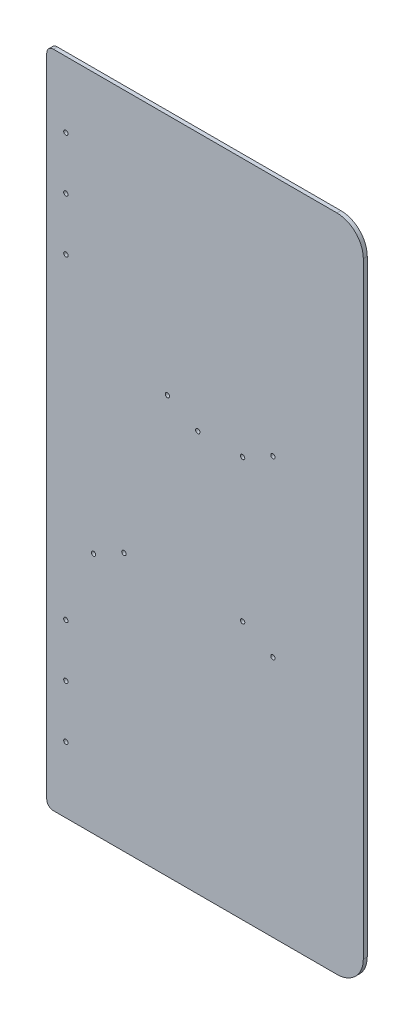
ISO-10303-21;
HEADER;
FILE_DESCRIPTION(('STEP AP214'),'2;1');
FILE_NAME('part.step','',(''),(''),'','','');
FILE_SCHEMA(('AUTOMOTIVE_DESIGN { 1 0 10303 214 1 1 1 1 }'));
ENDSEC;
DATA;
#1=APPLICATION_CONTEXT('core data for automotive mechanical design processes');
#2=APPLICATION_PROTOCOL_DEFINITION('international standard','automotive_design',2000,#1);
#3=PRODUCT_CONTEXT('',#1,'mechanical');
#4=PRODUCT('Part','Part','',(#3));
#5=PRODUCT_RELATED_PRODUCT_CATEGORY('part','',(#4));
#6=PRODUCT_DEFINITION_FORMATION('','',#4);
#7=PRODUCT_DEFINITION_CONTEXT('part definition',#1,'design');
#8=PRODUCT_DEFINITION('design','',#6,#7);
#9=PRODUCT_DEFINITION_SHAPE('','',#8);
#10=(LENGTH_UNIT() NAMED_UNIT(*) SI_UNIT(.MILLI.,.METRE.));
#11=(NAMED_UNIT(*) PLANE_ANGLE_UNIT() SI_UNIT($,.RADIAN.));
#12=(NAMED_UNIT(*) SI_UNIT($,.STERADIAN.) SOLID_ANGLE_UNIT());
#13=UNCERTAINTY_MEASURE_WITH_UNIT(LENGTH_MEASURE(1.E-05),#10,'distance_accuracy_value','');
#14=(GEOMETRIC_REPRESENTATION_CONTEXT(3) GLOBAL_UNCERTAINTY_ASSIGNED_CONTEXT((#13)) GLOBAL_UNIT_ASSIGNED_CONTEXT((#10,
#11,#12)) REPRESENTATION_CONTEXT('',''));
#15=CARTESIAN_POINT('',(0.,0.,0.));
#16=DIRECTION('',(0.,0.,1.));
#17=DIRECTION('',(1.,0.,0.));
#18=AXIS2_PLACEMENT_3D('',#15,#16,#17);
#19=CARTESIAN_POINT('',(0.,0.,3.));
#20=DIRECTION('',(1.,0.,0.));
#21=DIRECTION('',(0.,1.,0.));
#22=AXIS2_PLACEMENT_3D('',#19,#20,#21);
#23=PLANE('',#22);
#24=DIRECTION('',(0.,-1.,0.));
#25=VECTOR('',#24,1.);
#26=CARTESIAN_POINT('',(0.,0.,3.));
#27=LINE('',#26,#25);
#28=CARTESIAN_POINT('',(0.,495.,3.));
#29=VERTEX_POINT('',#28);
#30=CARTESIAN_POINT('',(0.,5.,3.));
#31=VERTEX_POINT('',#30);
#32=EDGE_CURVE('E116',#29,#31,#27,.T.);
#33=ORIENTED_EDGE('',*,*,#32,.F.);
#34=DIRECTION('',(0.,0.,-1.));
#35=VECTOR('',#34,1.);
#36=CARTESIAN_POINT('',(0.,495.,3.));
#37=LINE('',#36,#35);
#38=CARTESIAN_POINT('',(0.,495.,0.));
#39=VERTEX_POINT('',#38);
#40=EDGE_CURVE('E186',#29,#39,#37,.T.);
#41=ORIENTED_EDGE('',*,*,#40,.T.);
#42=DIRECTION('',(0.,-1.,0.));
#43=VECTOR('',#42,1.);
#44=CARTESIAN_POINT('',(0.,0.,0.));
#45=LINE('',#44,#43);
#46=CARTESIAN_POINT('',(0.,5.,0.));
#47=VERTEX_POINT('',#46);
#48=EDGE_CURVE('E168',#39,#47,#45,.T.);
#49=ORIENTED_EDGE('',*,*,#48,.T.);
#50=DIRECTION('',(0.,0.,1.));
#51=VECTOR('',#50,1.);
#52=CARTESIAN_POINT('',(0.,5.,3.));
#53=LINE('',#52,#51);
#54=EDGE_CURVE('E142',#47,#31,#53,.T.);
#55=ORIENTED_EDGE('',*,*,#54,.T.);
#56=EDGE_LOOP('',(#33,#41,#49,#55));
#57=FACE_BOUND('',#56,.T.);
#58=ADVANCED_FACE('F17',(#57),#23,.F.);
#59=CARTESIAN_POINT('',(0.,0.,3.));
#60=DIRECTION('',(0.,1.,0.));
#61=DIRECTION('',(1.,0.,0.));
#62=AXIS2_PLACEMENT_3D('',#59,#60,#61);
#63=PLANE('',#62);
#64=DIRECTION('',(1.,0.,0.));
#65=VECTOR('',#64,1.);
#66=CARTESIAN_POINT('',(0.,0.,3.));
#67=LINE('',#66,#65);
#68=CARTESIAN_POINT('',(5.,0.,3.));
#69=VERTEX_POINT('',#68);
#70=CARTESIAN_POINT('',(220.,0.,3.));
#71=VERTEX_POINT('',#70);
#72=EDGE_CURVE('E26',#69,#71,#67,.T.);
#73=ORIENTED_EDGE('',*,*,#72,.F.);
#74=DIRECTION('',(0.,0.,-1.));
#75=VECTOR('',#74,1.);
#76=CARTESIAN_POINT('',(5.,0.,3.));
#77=LINE('',#76,#75);
#78=CARTESIAN_POINT('',(5.,0.,0.));
#79=VERTEX_POINT('',#78);
#80=EDGE_CURVE('E122',#69,#79,#77,.T.);
#81=ORIENTED_EDGE('',*,*,#80,.T.);
#82=DIRECTION('',(1.,0.,0.));
#83=VECTOR('',#82,1.);
#84=CARTESIAN_POINT('',(0.,0.,0.));
#85=LINE('',#84,#83);
#86=CARTESIAN_POINT('',(220.,0.,0.));
#87=VERTEX_POINT('',#86);
#88=EDGE_CURVE('E98',#79,#87,#85,.T.);
#89=ORIENTED_EDGE('',*,*,#88,.T.);
#90=DIRECTION('',(0.,0.,1.));
#91=VECTOR('',#90,1.);
#92=CARTESIAN_POINT('',(220.,0.,3.));
#93=LINE('',#92,#91);
#94=EDGE_CURVE('E125',#87,#71,#93,.T.);
#95=ORIENTED_EDGE('',*,*,#94,.T.);
#96=EDGE_LOOP('',(#73,#81,#89,#95));
#97=FACE_BOUND('',#96,.T.);
#98=ADVANCED_FACE('F19',(#97),#63,.F.);
#99=CARTESIAN_POINT('',(240.,0.,3.));
#100=DIRECTION('',(-1.,0.,0.));
#101=DIRECTION('',(0.,0.,1.));
#102=AXIS2_PLACEMENT_3D('',#99,#100,#101);
#103=PLANE('',#102);
#104=DIRECTION('',(0.,1.,0.));
#105=VECTOR('',#104,1.);
#106=CARTESIAN_POINT('',(240.,0.,0.));
#107=LINE('',#106,#105);
#108=CARTESIAN_POINT('',(240.,20.,0.));
#109=VERTEX_POINT('',#108);
#110=CARTESIAN_POINT('',(240.,480.,0.));
#111=VERTEX_POINT('',#110);
#112=EDGE_CURVE('E53',#109,#111,#107,.T.);
#113=ORIENTED_EDGE('',*,*,#112,.T.);
#114=DIRECTION('',(0.,0.,1.));
#115=VECTOR('',#114,1.);
#116=CARTESIAN_POINT('',(240.,480.,3.));
#117=LINE('',#116,#115);
#118=CARTESIAN_POINT('',(240.,480.,3.));
#119=VERTEX_POINT('',#118);
#120=EDGE_CURVE('E205',#111,#119,#117,.T.);
#121=ORIENTED_EDGE('',*,*,#120,.T.);
#122=DIRECTION('',(0.,1.,0.));
#123=VECTOR('',#122,1.);
#124=CARTESIAN_POINT('',(240.,0.,3.));
#125=LINE('',#124,#123);
#126=CARTESIAN_POINT('',(240.,20.,3.));
#127=VERTEX_POINT('',#126);
#128=EDGE_CURVE('E11',#127,#119,#125,.T.);
#129=ORIENTED_EDGE('',*,*,#128,.F.);
#130=DIRECTION('',(0.,0.,-1.));
#131=VECTOR('',#130,1.);
#132=CARTESIAN_POINT('',(240.,20.,3.));
#133=LINE('',#132,#131);
#134=EDGE_CURVE('E198',#127,#109,#133,.T.);
#135=ORIENTED_EDGE('',*,*,#134,.T.);
#136=EDGE_LOOP('',(#113,#121,#129,#135));
#137=FACE_BOUND('',#136,.T.);
#138=ADVANCED_FACE('F290',(#137),#103,.F.);
#139=CARTESIAN_POINT('',(0.,500.,3.));
#140=DIRECTION('',(0.,-1.,0.));
#141=DIRECTION('',(0.,0.,-1.));
#142=AXIS2_PLACEMENT_3D('',#139,#140,#141);
#143=PLANE('',#142);
#144=DIRECTION('',(-1.,0.,0.));
#145=VECTOR('',#144,1.);
#146=CARTESIAN_POINT('',(0.,500.,0.));
#147=LINE('',#146,#145);
#148=CARTESIAN_POINT('',(220.,500.,0.));
#149=VERTEX_POINT('',#148);
#150=CARTESIAN_POINT('',(5.,500.,0.));
#151=VERTEX_POINT('',#150);
#152=EDGE_CURVE('E39',#149,#151,#147,.T.);
#153=ORIENTED_EDGE('',*,*,#152,.T.);
#154=DIRECTION('',(0.,0.,1.));
#155=VECTOR('',#154,1.);
#156=CARTESIAN_POINT('',(5.,500.,3.));
#157=LINE('',#156,#155);
#158=CARTESIAN_POINT('',(5.,500.,3.));
#159=VERTEX_POINT('',#158);
#160=EDGE_CURVE('E179',#151,#159,#157,.T.);
#161=ORIENTED_EDGE('',*,*,#160,.T.);
#162=DIRECTION('',(-1.,0.,0.));
#163=VECTOR('',#162,1.);
#164=CARTESIAN_POINT('',(0.,500.,3.));
#165=LINE('',#164,#163);
#166=CARTESIAN_POINT('',(220.,500.,3.));
#167=VERTEX_POINT('',#166);
#168=EDGE_CURVE('E157',#167,#159,#165,.T.);
#169=ORIENTED_EDGE('',*,*,#168,.F.);
#170=DIRECTION('',(0.,0.,-1.));
#171=VECTOR('',#170,1.);
#172=CARTESIAN_POINT('',(220.,500.,3.));
#173=LINE('',#172,#171);
#174=EDGE_CURVE('E209',#167,#149,#173,.T.);
#175=ORIENTED_EDGE('',*,*,#174,.T.);
#176=EDGE_LOOP('',(#153,#161,#169,#175));
#177=FACE_BOUND('',#176,.T.);
#178=ADVANCED_FACE('F278',(#177),#143,.F.);
#179=CARTESIAN_POINT('',(0.,0.,3.));
#180=DIRECTION('',(0.,0.,-1.));
#181=DIRECTION('',(0.,-1.,0.));
#182=AXIS2_PLACEMENT_3D('',#179,#180,#181);
#183=PLANE('',#182);
#184=CARTESIAN_POINT('',(14.5000000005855,449.999999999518,3.));
#185=DIRECTION('',(0.,0.,-1.));
#186=DIRECTION('',(-1.,0.,0.));
#187=AXIS2_PLACEMENT_3D('',#184,#185,#186);
#188=CIRCLE('',#187,1.65000000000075);
#189=CARTESIAN_POINT('',(12.8500000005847,449.999999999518,3.));
#190=VERTEX_POINT('',#189);
#191=EDGE_CURVE('E662',#190,#190,#188,.T.);
#192=ORIENTED_EDGE('',*,*,#191,.T.);
#193=EDGE_LOOP('',(#192));
#194=FACE_BOUND('',#193,.T.);
#195=CARTESIAN_POINT('',(14.5000000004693,409.999999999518,3.));
#196=DIRECTION('',(0.,0.,-1.));
#197=DIRECTION('',(-1.,0.,0.));
#198=AXIS2_PLACEMENT_3D('',#195,#196,#197);
#199=CIRCLE('',#198,1.65000000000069);
#200=CARTESIAN_POINT('',(12.8500000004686,409.999999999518,3.));
#201=VERTEX_POINT('',#200);
#202=EDGE_CURVE('E646',#201,#201,#199,.T.);
#203=ORIENTED_EDGE('',*,*,#202,.T.);
#204=EDGE_LOOP('',(#203));
#205=FACE_BOUND('',#204,.T.);
#206=CARTESIAN_POINT('',(14.5000000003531,369.999999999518,3.));
#207=DIRECTION('',(0.,0.,-1.));
#208=DIRECTION('',(-1.,0.,0.));
#209=AXIS2_PLACEMENT_3D('',#206,#207,#208);
#210=CIRCLE('',#209,1.65000000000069);
#211=CARTESIAN_POINT('',(12.8500000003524,369.999999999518,3.));
#212=VERTEX_POINT('',#211);
#213=EDGE_CURVE('E630',#212,#212,#210,.T.);
#214=ORIENTED_EDGE('',*,*,#213,.T.);
#215=EDGE_LOOP('',(#214));
#216=FACE_BOUND('',#215,.T.);
#217=CARTESIAN_POINT('',(14.5000000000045,49.9999999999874,3.));
#218=DIRECTION('',(0.,0.,1.));
#219=DIRECTION('',(1.,0.,0.));
#220=AXIS2_PLACEMENT_3D('',#217,#218,#219);
#221=CIRCLE('',#220,1.64999999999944);
#222=CARTESIAN_POINT('',(16.1500000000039,49.9999999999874,3.));
#223=VERTEX_POINT('',#222);
#224=EDGE_CURVE('E607',#223,#223,#221,.T.);
#225=ORIENTED_EDGE('',*,*,#224,.F.);
#226=EDGE_LOOP('',(#225));
#227=FACE_BOUND('',#226,.T.);
#228=CARTESIAN_POINT('',(14.5000000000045,129.999999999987,3.));
#229=DIRECTION('',(0.,0.,1.));
#230=DIRECTION('',(1.,0.,0.));
#231=AXIS2_PLACEMENT_3D('',#228,#229,#230);
#232=CIRCLE('',#231,1.64999999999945);
#233=CARTESIAN_POINT('',(16.1500000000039,129.999999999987,3.));
#234=VERTEX_POINT('',#233);
#235=EDGE_CURVE('E159',#234,#234,#232,.T.);
#236=ORIENTED_EDGE('',*,*,#235,.F.);
#237=EDGE_LOOP('',(#236));
#238=FACE_BOUND('',#237,.T.);
#239=CARTESIAN_POINT('',(14.5000000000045,89.9999999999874,3.));
#240=DIRECTION('',(0.,0.,1.));
#241=DIRECTION('',(1.,0.,0.));
#242=AXIS2_PLACEMENT_3D('',#239,#240,#241);
#243=CIRCLE('',#242,1.64999999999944);
#244=CARTESIAN_POINT('',(16.1500000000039,89.9999999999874,3.));
#245=VERTEX_POINT('',#244);
#246=EDGE_CURVE('E143',#245,#245,#243,.T.);
#247=ORIENTED_EDGE('',*,*,#246,.F.);
#248=EDGE_LOOP('',(#247));
#249=FACE_BOUND('',#248,.T.);
#250=CARTESIAN_POINT('',(148.500000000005,303.999999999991,3.));
#251=DIRECTION('',(0.,0.,1.));
#252=DIRECTION('',(1.,0.,0.));
#253=AXIS2_PLACEMENT_3D('',#250,#251,#252);
#254=CIRCLE('',#253,1.64999999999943);
#255=CARTESIAN_POINT('',(150.150000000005,303.999999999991,3.));
#256=VERTEX_POINT('',#255);
#257=EDGE_CURVE('E222',#256,#256,#254,.T.);
#258=ORIENTED_EDGE('',*,*,#257,.F.);
#259=EDGE_LOOP('',(#258));
#260=FACE_BOUND('',#259,.T.);
#261=CARTESIAN_POINT('',(171.500000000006,315.999999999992,3.));
#262=DIRECTION('',(0.,0.,1.));
#263=DIRECTION('',(1.,0.,0.));
#264=AXIS2_PLACEMENT_3D('',#261,#262,#263);
#265=CIRCLE('',#264,1.64999999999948);
#266=CARTESIAN_POINT('',(173.150000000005,315.999999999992,3.));
#267=VERTEX_POINT('',#266);
#268=EDGE_CURVE('E234',#267,#267,#265,.T.);
#269=ORIENTED_EDGE('',*,*,#268,.F.);
#270=EDGE_LOOP('',(#269));
#271=FACE_BOUND('',#270,.T.);
#272=CARTESIAN_POINT('',(35.5000000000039,183.999999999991,3.));
#273=DIRECTION('',(0.,0.,1.));
#274=DIRECTION('',(1.,0.,0.));
#275=AXIS2_PLACEMENT_3D('',#272,#273,#274);
#276=CIRCLE('',#275,1.64999999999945);
#277=CARTESIAN_POINT('',(37.1500000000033,183.999999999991,3.));
#278=VERTEX_POINT('',#277);
#279=EDGE_CURVE('E239',#278,#278,#276,.T.);
#280=ORIENTED_EDGE('',*,*,#279,.F.);
#281=EDGE_LOOP('',(#280));
#282=FACE_BOUND('',#281,.T.);
#283=CARTESIAN_POINT('',(58.5000000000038,195.999999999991,3.));
#284=DIRECTION('',(0.,0.,1.));
#285=DIRECTION('',(1.,0.,0.));
#286=AXIS2_PLACEMENT_3D('',#283,#284,#285);
#287=CIRCLE('',#286,1.64999999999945);
#288=CARTESIAN_POINT('',(60.1500000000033,195.999999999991,3.));
#289=VERTEX_POINT('',#288);
#290=EDGE_CURVE('E244',#289,#289,#287,.T.);
#291=ORIENTED_EDGE('',*,*,#290,.F.);
#292=EDGE_LOOP('',(#291));
#293=FACE_BOUND('',#292,.T.);
#294=CARTESIAN_POINT('',(91.5000000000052,315.999999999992,3.));
#295=DIRECTION('',(0.,0.,1.));
#296=DIRECTION('',(1.,0.,0.));
#297=AXIS2_PLACEMENT_3D('',#294,#295,#296);
#298=CIRCLE('',#297,1.64999999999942);
#299=CARTESIAN_POINT('',(93.1500000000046,315.999999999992,3.));
#300=VERTEX_POINT('',#299);
#301=EDGE_CURVE('E215',#300,#300,#298,.T.);
#302=ORIENTED_EDGE('',*,*,#301,.F.);
#303=EDGE_LOOP('',(#302));
#304=FACE_BOUND('',#303,.T.);
#305=CARTESIAN_POINT('',(148.500000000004,195.999999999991,3.));
#306=DIRECTION('',(0.,0.,1.));
#307=DIRECTION('',(1.,0.,0.));
#308=AXIS2_PLACEMENT_3D('',#305,#306,#307);
#309=CIRCLE('',#308,1.64999999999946);
#310=CARTESIAN_POINT('',(150.150000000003,195.999999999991,3.));
#311=VERTEX_POINT('',#310);
#312=EDGE_CURVE('E214',#311,#311,#309,.T.);
#313=ORIENTED_EDGE('',*,*,#312,.F.);
#314=EDGE_LOOP('',(#313));
#315=FACE_BOUND('',#314,.T.);
#316=CARTESIAN_POINT('',(171.500000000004,183.999999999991,3.));
#317=DIRECTION('',(0.,0.,1.));
#318=DIRECTION('',(1.,0.,0.));
#319=AXIS2_PLACEMENT_3D('',#316,#317,#318);
#320=CIRCLE('',#319,1.6499999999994);
#321=CARTESIAN_POINT('',(173.150000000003,183.999999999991,3.));
#322=VERTEX_POINT('',#321);
#323=EDGE_CURVE('E260',#322,#322,#320,.T.);
#324=ORIENTED_EDGE('',*,*,#323,.F.);
#325=EDGE_LOOP('',(#324));
#326=FACE_BOUND('',#325,.T.);
#327=CARTESIAN_POINT('',(114.500000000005,303.999999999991,3.));
#328=DIRECTION('',(0.,0.,1.));
#329=DIRECTION('',(1.,0.,0.));
#330=AXIS2_PLACEMENT_3D('',#327,#328,#329);
#331=CIRCLE('',#330,1.64999999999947);
#332=CARTESIAN_POINT('',(116.150000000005,303.999999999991,3.));
#333=VERTEX_POINT('',#332);
#334=EDGE_CURVE('E164',#333,#333,#331,.T.);
#335=ORIENTED_EDGE('',*,*,#334,.F.);
#336=EDGE_LOOP('',(#335));
#337=FACE_BOUND('',#336,.T.);
#338=ORIENTED_EDGE('',*,*,#168,.T.);
#339=CARTESIAN_POINT('',(5.,495.,3.));
#340=DIRECTION('',(0.,0.,1.));
#341=DIRECTION('',(-1.,0.,0.));
#342=AXIS2_PLACEMENT_3D('',#339,#340,#341);
#343=CIRCLE('',#342,5.);
#344=EDGE_CURVE('E138',#159,#29,#343,.T.);
#345=ORIENTED_EDGE('',*,*,#344,.T.);
#346=ORIENTED_EDGE('',*,*,#32,.T.);
#347=CARTESIAN_POINT('',(5.,5.,3.));
#348=DIRECTION('',(0.,0.,1.));
#349=DIRECTION('',(-1.,0.,0.));
#350=AXIS2_PLACEMENT_3D('',#347,#348,#349);
#351=CIRCLE('',#350,5.);
#352=EDGE_CURVE('E134',#31,#69,#351,.T.);
#353=ORIENTED_EDGE('',*,*,#352,.T.);
#354=ORIENTED_EDGE('',*,*,#72,.T.);
#355=CARTESIAN_POINT('',(220.,20.,3.));
#356=DIRECTION('',(0.,0.,1.));
#357=DIRECTION('',(-1.,0.,0.));
#358=AXIS2_PLACEMENT_3D('',#355,#356,#357);
#359=CIRCLE('',#358,20.);
#360=EDGE_CURVE('E190',#71,#127,#359,.T.);
#361=ORIENTED_EDGE('',*,*,#360,.T.);
#362=ORIENTED_EDGE('',*,*,#128,.T.);
#363=CARTESIAN_POINT('',(220.,480.,3.));
#364=DIRECTION('',(0.,0.,1.));
#365=DIRECTION('',(-1.,0.,0.));
#366=AXIS2_PLACEMENT_3D('',#363,#364,#365);
#367=CIRCLE('',#366,20.);
#368=EDGE_CURVE('E201',#119,#167,#367,.T.);
#369=ORIENTED_EDGE('',*,*,#368,.T.);
#370=EDGE_LOOP('',(#338,#345,#346,#353,#354,#361,#362,#369));
#371=FACE_BOUND('',#370,.T.);
#372=ADVANCED_FACE('F140',(#194,#205,#216,#227,#238,#249,#260,#271,#282,#293,#304,#315,#326,
#337,#371),#183,.F.);
#373=CARTESIAN_POINT('',(0.,0.,0.));
#374=DIRECTION('',(0.,0.,-1.));
#375=DIRECTION('',(0.,-1.,0.));
#376=AXIS2_PLACEMENT_3D('',#373,#374,#375);
#377=PLANE('',#376);
#378=CARTESIAN_POINT('',(14.5000000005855,449.999999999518,0.));
#379=DIRECTION('',(0.,0.,-1.));
#380=DIRECTION('',(-1.,0.,0.));
#381=AXIS2_PLACEMENT_3D('',#378,#379,#380);
#382=CIRCLE('',#381,1.65000000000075);
#383=CARTESIAN_POINT('',(12.8500000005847,449.999999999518,0.));
#384=VERTEX_POINT('',#383);
#385=EDGE_CURVE('E654',#384,#384,#382,.T.);
#386=ORIENTED_EDGE('',*,*,#385,.F.);
#387=EDGE_LOOP('',(#386));
#388=FACE_BOUND('',#387,.T.);
#389=CARTESIAN_POINT('',(14.5000000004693,409.999999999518,0.));
#390=DIRECTION('',(0.,0.,-1.));
#391=DIRECTION('',(-1.,0.,0.));
#392=AXIS2_PLACEMENT_3D('',#389,#390,#391);
#393=CIRCLE('',#392,1.65000000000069);
#394=CARTESIAN_POINT('',(12.8500000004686,409.999999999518,0.));
#395=VERTEX_POINT('',#394);
#396=EDGE_CURVE('E638',#395,#395,#393,.T.);
#397=ORIENTED_EDGE('',*,*,#396,.F.);
#398=EDGE_LOOP('',(#397));
#399=FACE_BOUND('',#398,.T.);
#400=CARTESIAN_POINT('',(14.5000000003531,369.999999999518,0.));
#401=DIRECTION('',(0.,0.,-1.));
#402=DIRECTION('',(-1.,0.,0.));
#403=AXIS2_PLACEMENT_3D('',#400,#401,#402);
#404=CIRCLE('',#403,1.65000000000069);
#405=CARTESIAN_POINT('',(12.8500000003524,369.999999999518,0.));
#406=VERTEX_POINT('',#405);
#407=EDGE_CURVE('E622',#406,#406,#404,.T.);
#408=ORIENTED_EDGE('',*,*,#407,.F.);
#409=EDGE_LOOP('',(#408));
#410=FACE_BOUND('',#409,.T.);
#411=CARTESIAN_POINT('',(14.5000000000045,49.9999999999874,0.));
#412=DIRECTION('',(0.,0.,-1.));
#413=DIRECTION('',(-1.,0.,0.));
#414=AXIS2_PLACEMENT_3D('',#411,#412,#413);
#415=CIRCLE('',#414,1.64999999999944);
#416=CARTESIAN_POINT('',(12.8500000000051,49.9999999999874,0.));
#417=VERTEX_POINT('',#416);
#418=EDGE_CURVE('E614',#417,#417,#415,.T.);
#419=ORIENTED_EDGE('',*,*,#418,.F.);
#420=EDGE_LOOP('',(#419));
#421=FACE_BOUND('',#420,.T.);
#422=CARTESIAN_POINT('',(14.5000000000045,129.999999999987,0.));
#423=DIRECTION('',(0.,0.,-1.));
#424=DIRECTION('',(-1.,0.,0.));
#425=AXIS2_PLACEMENT_3D('',#422,#423,#424);
#426=CIRCLE('',#425,1.64999999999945);
#427=CARTESIAN_POINT('',(12.8500000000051,129.999999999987,0.));
#428=VERTEX_POINT('',#427);
#429=EDGE_CURVE('E163',#428,#428,#426,.T.);
#430=ORIENTED_EDGE('',*,*,#429,.F.);
#431=EDGE_LOOP('',(#430));
#432=FACE_BOUND('',#431,.T.);
#433=CARTESIAN_POINT('',(14.5000000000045,89.9999999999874,0.));
#434=DIRECTION('',(0.,0.,-1.));
#435=DIRECTION('',(-1.,0.,0.));
#436=AXIS2_PLACEMENT_3D('',#433,#434,#435);
#437=CIRCLE('',#436,1.64999999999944);
#438=CARTESIAN_POINT('',(12.8500000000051,89.9999999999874,0.));
#439=VERTEX_POINT('',#438);
#440=EDGE_CURVE('E153',#439,#439,#437,.T.);
#441=ORIENTED_EDGE('',*,*,#440,.F.);
#442=EDGE_LOOP('',(#441));
#443=FACE_BOUND('',#442,.T.);
#444=CARTESIAN_POINT('',(148.500000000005,303.999999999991,0.));
#445=DIRECTION('',(0.,0.,1.));
#446=DIRECTION('',(1.,0.,0.));
#447=AXIS2_PLACEMENT_3D('',#444,#445,#446);
#448=CIRCLE('',#447,1.64999999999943);
#449=CARTESIAN_POINT('',(150.150000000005,303.999999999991,0.));
#450=VERTEX_POINT('',#449);
#451=EDGE_CURVE('E218',#450,#450,#448,.T.);
#452=ORIENTED_EDGE('',*,*,#451,.T.);
#453=EDGE_LOOP('',(#452));
#454=FACE_BOUND('',#453,.T.);
#455=CARTESIAN_POINT('',(171.500000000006,315.999999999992,0.));
#456=DIRECTION('',(0.,0.,1.));
#457=DIRECTION('',(1.,0.,0.));
#458=AXIS2_PLACEMENT_3D('',#455,#456,#457);
#459=CIRCLE('',#458,1.64999999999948);
#460=CARTESIAN_POINT('',(173.150000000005,315.999999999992,0.));
#461=VERTEX_POINT('',#460);
#462=EDGE_CURVE('E226',#461,#461,#459,.T.);
#463=ORIENTED_EDGE('',*,*,#462,.T.);
#464=EDGE_LOOP('',(#463));
#465=FACE_BOUND('',#464,.T.);
#466=CARTESIAN_POINT('',(35.5000000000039,183.999999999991,0.));
#467=DIRECTION('',(0.,0.,1.));
#468=DIRECTION('',(1.,0.,0.));
#469=AXIS2_PLACEMENT_3D('',#466,#467,#468);
#470=CIRCLE('',#469,1.64999999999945);
#471=CARTESIAN_POINT('',(37.1500000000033,183.999999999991,0.));
#472=VERTEX_POINT('',#471);
#473=EDGE_CURVE('E238',#472,#472,#470,.T.);
#474=ORIENTED_EDGE('',*,*,#473,.T.);
#475=EDGE_LOOP('',(#474));
#476=FACE_BOUND('',#475,.T.);
#477=CARTESIAN_POINT('',(58.5000000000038,195.999999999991,0.));
#478=DIRECTION('',(0.,0.,1.));
#479=DIRECTION('',(1.,0.,0.));
#480=AXIS2_PLACEMENT_3D('',#477,#478,#479);
#481=CIRCLE('',#480,1.64999999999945);
#482=CARTESIAN_POINT('',(60.1500000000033,195.999999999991,0.));
#483=VERTEX_POINT('',#482);
#484=EDGE_CURVE('E243',#483,#483,#481,.T.);
#485=ORIENTED_EDGE('',*,*,#484,.T.);
#486=EDGE_LOOP('',(#485));
#487=FACE_BOUND('',#486,.T.);
#488=CARTESIAN_POINT('',(91.5000000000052,315.999999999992,0.));
#489=DIRECTION('',(0.,0.,1.));
#490=DIRECTION('',(1.,0.,0.));
#491=AXIS2_PLACEMENT_3D('',#488,#489,#490);
#492=CIRCLE('',#491,1.64999999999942);
#493=CARTESIAN_POINT('',(93.1500000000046,315.999999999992,0.));
#494=VERTEX_POINT('',#493);
#495=EDGE_CURVE('E248',#494,#494,#492,.T.);
#496=ORIENTED_EDGE('',*,*,#495,.T.);
#497=EDGE_LOOP('',(#496));
#498=FACE_BOUND('',#497,.T.);
#499=CARTESIAN_POINT('',(148.500000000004,195.999999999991,0.));
#500=DIRECTION('',(0.,0.,1.));
#501=DIRECTION('',(1.,0.,0.));
#502=AXIS2_PLACEMENT_3D('',#499,#500,#501);
#503=CIRCLE('',#502,1.64999999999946);
#504=CARTESIAN_POINT('',(150.150000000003,195.999999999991,0.));
#505=VERTEX_POINT('',#504);
#506=EDGE_CURVE('E210',#505,#505,#503,.T.);
#507=ORIENTED_EDGE('',*,*,#506,.T.);
#508=EDGE_LOOP('',(#507));
#509=FACE_BOUND('',#508,.T.);
#510=CARTESIAN_POINT('',(171.500000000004,183.999999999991,0.));
#511=DIRECTION('',(0.,0.,1.));
#512=DIRECTION('',(1.,0.,0.));
#513=AXIS2_PLACEMENT_3D('',#510,#511,#512);
#514=CIRCLE('',#513,1.6499999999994);
#515=CARTESIAN_POINT('',(173.150000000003,183.999999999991,0.));
#516=VERTEX_POINT('',#515);
#517=EDGE_CURVE('E230',#516,#516,#514,.T.);
#518=ORIENTED_EDGE('',*,*,#517,.T.);
#519=EDGE_LOOP('',(#518));
#520=FACE_BOUND('',#519,.T.);
#521=CARTESIAN_POINT('',(114.500000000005,303.999999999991,0.));
#522=DIRECTION('',(0.,0.,1.));
#523=DIRECTION('',(1.,0.,0.));
#524=AXIS2_PLACEMENT_3D('',#521,#522,#523);
#525=CIRCLE('',#524,1.64999999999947);
#526=CARTESIAN_POINT('',(116.150000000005,303.999999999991,0.));
#527=VERTEX_POINT('',#526);
#528=EDGE_CURVE('E169',#527,#527,#525,.T.);
#529=ORIENTED_EDGE('',*,*,#528,.T.);
#530=EDGE_LOOP('',(#529));
#531=FACE_BOUND('',#530,.T.);
#532=ORIENTED_EDGE('',*,*,#48,.F.);
#533=CARTESIAN_POINT('',(5.,495.,0.));
#534=DIRECTION('',(0.,0.,-1.));
#535=DIRECTION('',(-1.,0.,0.));
#536=AXIS2_PLACEMENT_3D('',#533,#534,#535);
#537=CIRCLE('',#536,5.);
#538=EDGE_CURVE('E183',#39,#151,#537,.T.);
#539=ORIENTED_EDGE('',*,*,#538,.T.);
#540=ORIENTED_EDGE('',*,*,#152,.F.);
#541=CARTESIAN_POINT('',(220.,480.,0.));
#542=DIRECTION('',(0.,0.,-1.));
#543=DIRECTION('',(-1.,0.,0.));
#544=AXIS2_PLACEMENT_3D('',#541,#542,#543);
#545=CIRCLE('',#544,20.);
#546=EDGE_CURVE('E206',#149,#111,#545,.T.);
#547=ORIENTED_EDGE('',*,*,#546,.T.);
#548=ORIENTED_EDGE('',*,*,#112,.F.);
#549=CARTESIAN_POINT('',(220.,20.,0.));
#550=DIRECTION('',(0.,0.,-1.));
#551=DIRECTION('',(-1.,0.,0.));
#552=AXIS2_PLACEMENT_3D('',#549,#550,#551);
#553=CIRCLE('',#552,20.);
#554=EDGE_CURVE('E194',#109,#87,#553,.T.);
#555=ORIENTED_EDGE('',*,*,#554,.T.);
#556=ORIENTED_EDGE('',*,*,#88,.F.);
#557=CARTESIAN_POINT('',(5.,5.,0.));
#558=DIRECTION('',(0.,0.,-1.));
#559=DIRECTION('',(-1.,0.,0.));
#560=AXIS2_PLACEMENT_3D('',#557,#558,#559);
#561=CIRCLE('',#560,5.);
#562=EDGE_CURVE('E136',#79,#47,#561,.T.);
#563=ORIENTED_EDGE('',*,*,#562,.T.);
#564=EDGE_LOOP('',(#532,#539,#540,#547,#548,#555,#556,#563));
#565=FACE_BOUND('',#564,.T.);
#566=ADVANCED_FACE('F284',(#388,#399,#410,#421,#432,#443,#454,#465,#476,#487,#498,#509,#520,
#531,#565),#377,.T.);
#567=CARTESIAN_POINT('',(114.500000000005,303.999999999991,0.));
#568=DIRECTION('',(0.,0.,1.));
#569=DIRECTION('',(1.,0.,0.));
#570=AXIS2_PLACEMENT_3D('',#567,#568,#569);
#571=CYLINDRICAL_SURFACE('',#570,1.64999999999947);
#572=ORIENTED_EDGE('',*,*,#334,.T.);
#573=EDGE_LOOP('',(#572));
#574=FACE_BOUND('',#573,.T.);
#575=ORIENTED_EDGE('',*,*,#528,.F.);
#576=EDGE_LOOP('',(#575));
#577=FACE_BOUND('',#576,.T.);
#578=ADVANCED_FACE('F321',(#574,#577),#571,.F.);
#579=CARTESIAN_POINT('',(171.500000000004,183.999999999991,0.));
#580=DIRECTION('',(0.,0.,1.));
#581=DIRECTION('',(1.,0.,0.));
#582=AXIS2_PLACEMENT_3D('',#579,#580,#581);
#583=CYLINDRICAL_SURFACE('',#582,1.6499999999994);
#584=ORIENTED_EDGE('',*,*,#323,.T.);
#585=EDGE_LOOP('',(#584));
#586=FACE_BOUND('',#585,.T.);
#587=ORIENTED_EDGE('',*,*,#517,.F.);
#588=EDGE_LOOP('',(#587));
#589=FACE_BOUND('',#588,.T.);
#590=ADVANCED_FACE('F317',(#586,#589),#583,.F.);
#591=CARTESIAN_POINT('',(148.500000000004,195.999999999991,0.));
#592=DIRECTION('',(0.,0.,1.));
#593=DIRECTION('',(1.,0.,0.));
#594=AXIS2_PLACEMENT_3D('',#591,#592,#593);
#595=CYLINDRICAL_SURFACE('',#594,1.64999999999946);
#596=ORIENTED_EDGE('',*,*,#312,.T.);
#597=EDGE_LOOP('',(#596));
#598=FACE_BOUND('',#597,.T.);
#599=ORIENTED_EDGE('',*,*,#506,.F.);
#600=EDGE_LOOP('',(#599));
#601=FACE_BOUND('',#600,.T.);
#602=ADVANCED_FACE('F320',(#598,#601),#595,.F.);
#603=CARTESIAN_POINT('',(91.5000000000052,315.999999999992,0.));
#604=DIRECTION('',(0.,0.,1.));
#605=DIRECTION('',(1.,0.,0.));
#606=AXIS2_PLACEMENT_3D('',#603,#604,#605);
#607=CYLINDRICAL_SURFACE('',#606,1.64999999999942);
#608=ORIENTED_EDGE('',*,*,#301,.T.);
#609=EDGE_LOOP('',(#608));
#610=FACE_BOUND('',#609,.T.);
#611=ORIENTED_EDGE('',*,*,#495,.F.);
#612=EDGE_LOOP('',(#611));
#613=FACE_BOUND('',#612,.T.);
#614=ADVANCED_FACE('F373',(#610,#613),#607,.F.);
#615=CARTESIAN_POINT('',(58.5000000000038,195.999999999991,0.));
#616=DIRECTION('',(0.,0.,1.));
#617=DIRECTION('',(1.,0.,0.));
#618=AXIS2_PLACEMENT_3D('',#615,#616,#617);
#619=CYLINDRICAL_SURFACE('',#618,1.64999999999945);
#620=ORIENTED_EDGE('',*,*,#290,.T.);
#621=EDGE_LOOP('',(#620));
#622=FACE_BOUND('',#621,.T.);
#623=ORIENTED_EDGE('',*,*,#484,.F.);
#624=EDGE_LOOP('',(#623));
#625=FACE_BOUND('',#624,.T.);
#626=ADVANCED_FACE('F382',(#622,#625),#619,.F.);
#627=CARTESIAN_POINT('',(35.5000000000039,183.999999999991,0.));
#628=DIRECTION('',(0.,0.,1.));
#629=DIRECTION('',(1.,0.,0.));
#630=AXIS2_PLACEMENT_3D('',#627,#628,#629);
#631=CYLINDRICAL_SURFACE('',#630,1.64999999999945);
#632=ORIENTED_EDGE('',*,*,#279,.T.);
#633=EDGE_LOOP('',(#632));
#634=FACE_BOUND('',#633,.T.);
#635=ORIENTED_EDGE('',*,*,#473,.F.);
#636=EDGE_LOOP('',(#635));
#637=FACE_BOUND('',#636,.T.);
#638=ADVANCED_FACE('F315',(#634,#637),#631,.F.);
#639=CARTESIAN_POINT('',(171.500000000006,315.999999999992,0.));
#640=DIRECTION('',(0.,0.,1.));
#641=DIRECTION('',(1.,0.,0.));
#642=AXIS2_PLACEMENT_3D('',#639,#640,#641);
#643=CYLINDRICAL_SURFACE('',#642,1.64999999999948);
#644=ORIENTED_EDGE('',*,*,#268,.T.);
#645=EDGE_LOOP('',(#644));
#646=FACE_BOUND('',#645,.T.);
#647=ORIENTED_EDGE('',*,*,#462,.F.);
#648=EDGE_LOOP('',(#647));
#649=FACE_BOUND('',#648,.T.);
#650=ADVANCED_FACE('F305',(#646,#649),#643,.F.);
#651=CARTESIAN_POINT('',(148.500000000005,303.999999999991,0.));
#652=DIRECTION('',(0.,0.,1.));
#653=DIRECTION('',(1.,0.,0.));
#654=AXIS2_PLACEMENT_3D('',#651,#652,#653);
#655=CYLINDRICAL_SURFACE('',#654,1.64999999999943);
#656=ORIENTED_EDGE('',*,*,#257,.T.);
#657=EDGE_LOOP('',(#656));
#658=FACE_BOUND('',#657,.T.);
#659=ORIENTED_EDGE('',*,*,#451,.F.);
#660=EDGE_LOOP('',(#659));
#661=FACE_BOUND('',#660,.T.);
#662=ADVANCED_FACE('F297',(#658,#661),#655,.F.);
#663=CARTESIAN_POINT('',(220.,480.,3.));
#664=DIRECTION('',(0.,0.,-1.));
#665=DIRECTION('',(-1.,0.,0.));
#666=AXIS2_PLACEMENT_3D('',#663,#664,#665);
#667=CYLINDRICAL_SURFACE('',#666,20.);
#668=ORIENTED_EDGE('',*,*,#368,.F.);
#669=ORIENTED_EDGE('',*,*,#120,.F.);
#670=ORIENTED_EDGE('',*,*,#546,.F.);
#671=ORIENTED_EDGE('',*,*,#174,.F.);
#672=EDGE_LOOP('',(#668,#669,#670,#671));
#673=FACE_BOUND('',#672,.T.);
#674=ADVANCED_FACE('F295',(#673),#667,.T.);
#675=CARTESIAN_POINT('',(220.,20.,3.));
#676=DIRECTION('',(0.,0.,-1.));
#677=DIRECTION('',(-1.,0.,0.));
#678=AXIS2_PLACEMENT_3D('',#675,#676,#677);
#679=CYLINDRICAL_SURFACE('',#678,20.);
#680=ORIENTED_EDGE('',*,*,#360,.F.);
#681=ORIENTED_EDGE('',*,*,#94,.F.);
#682=ORIENTED_EDGE('',*,*,#554,.F.);
#683=ORIENTED_EDGE('',*,*,#134,.F.);
#684=EDGE_LOOP('',(#680,#681,#682,#683));
#685=FACE_BOUND('',#684,.T.);
#686=ADVANCED_FACE('F288',(#685),#679,.T.);
#687=CARTESIAN_POINT('',(5.,495.,3.));
#688=DIRECTION('',(0.,0.,-1.));
#689=DIRECTION('',(-1.,0.,0.));
#690=AXIS2_PLACEMENT_3D('',#687,#688,#689);
#691=CYLINDRICAL_SURFACE('',#690,5.);
#692=ORIENTED_EDGE('',*,*,#344,.F.);
#693=ORIENTED_EDGE('',*,*,#160,.F.);
#694=ORIENTED_EDGE('',*,*,#538,.F.);
#695=ORIENTED_EDGE('',*,*,#40,.F.);
#696=EDGE_LOOP('',(#692,#693,#694,#695));
#697=FACE_BOUND('',#696,.T.);
#698=ADVANCED_FACE('F282',(#697),#691,.T.);
#699=CARTESIAN_POINT('',(5.,5.,3.));
#700=DIRECTION('',(0.,0.,-1.));
#701=DIRECTION('',(-1.,0.,0.));
#702=AXIS2_PLACEMENT_3D('',#699,#700,#701);
#703=CYLINDRICAL_SURFACE('',#702,5.);
#704=ORIENTED_EDGE('',*,*,#352,.F.);
#705=ORIENTED_EDGE('',*,*,#54,.F.);
#706=ORIENTED_EDGE('',*,*,#562,.F.);
#707=ORIENTED_EDGE('',*,*,#80,.F.);
#708=EDGE_LOOP('',(#704,#705,#706,#707));
#709=FACE_BOUND('',#708,.T.);
#710=ADVANCED_FACE('F132',(#709),#703,.T.);
#711=CARTESIAN_POINT('',(14.5000000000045,89.9999999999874,-1.));
#712=DIRECTION('',(0.,0.,1.));
#713=DIRECTION('',(1.,0.,0.));
#714=AXIS2_PLACEMENT_3D('',#711,#712,#713);
#715=CYLINDRICAL_SURFACE('',#714,1.64999999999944);
#716=ORIENTED_EDGE('',*,*,#246,.T.);
#717=EDGE_LOOP('',(#716));
#718=FACE_BOUND('',#717,.T.);
#719=ORIENTED_EDGE('',*,*,#440,.T.);
#720=EDGE_LOOP('',(#719));
#721=FACE_BOUND('',#720,.T.);
#722=ADVANCED_FACE('F446',(#718,#721),#715,.F.);
#723=CARTESIAN_POINT('',(14.5000000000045,129.999999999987,-1.));
#724=DIRECTION('',(0.,0.,1.));
#725=DIRECTION('',(1.,0.,0.));
#726=AXIS2_PLACEMENT_3D('',#723,#724,#725);
#727=CYLINDRICAL_SURFACE('',#726,1.64999999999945);
#728=ORIENTED_EDGE('',*,*,#235,.T.);
#729=EDGE_LOOP('',(#728));
#730=FACE_BOUND('',#729,.T.);
#731=ORIENTED_EDGE('',*,*,#429,.T.);
#732=EDGE_LOOP('',(#731));
#733=FACE_BOUND('',#732,.T.);
#734=ADVANCED_FACE('F456',(#730,#733),#727,.F.);
#735=CARTESIAN_POINT('',(14.5000000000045,49.9999999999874,-1.));
#736=DIRECTION('',(0.,0.,1.));
#737=DIRECTION('',(1.,0.,0.));
#738=AXIS2_PLACEMENT_3D('',#735,#736,#737);
#739=CYLINDRICAL_SURFACE('',#738,1.64999999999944);
#740=ORIENTED_EDGE('',*,*,#224,.T.);
#741=EDGE_LOOP('',(#740));
#742=FACE_BOUND('',#741,.T.);
#743=ORIENTED_EDGE('',*,*,#418,.T.);
#744=EDGE_LOOP('',(#743));
#745=FACE_BOUND('',#744,.T.);
#746=ADVANCED_FACE('F466',(#742,#745),#739,.F.);
#747=CARTESIAN_POINT('',(14.5000000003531,369.999999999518,4.));
#748=DIRECTION('',(0.,0.,-1.));
#749=DIRECTION('',(-1.,0.,0.));
#750=AXIS2_PLACEMENT_3D('',#747,#748,#749);
#751=CYLINDRICAL_SURFACE('',#750,1.65000000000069);
#752=ORIENTED_EDGE('',*,*,#407,.T.);
#753=EDGE_LOOP('',(#752));
#754=FACE_BOUND('',#753,.T.);
#755=ORIENTED_EDGE('',*,*,#213,.F.);
#756=EDGE_LOOP('',(#755));
#757=FACE_BOUND('',#756,.T.);
#758=ADVANCED_FACE('F477',(#754,#757),#751,.F.);
#759=CARTESIAN_POINT('',(14.5000000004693,409.999999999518,4.));
#760=DIRECTION('',(0.,0.,-1.));
#761=DIRECTION('',(-1.,0.,0.));
#762=AXIS2_PLACEMENT_3D('',#759,#760,#761);
#763=CYLINDRICAL_SURFACE('',#762,1.65000000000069);
#764=ORIENTED_EDGE('',*,*,#396,.T.);
#765=EDGE_LOOP('',(#764));
#766=FACE_BOUND('',#765,.T.);
#767=ORIENTED_EDGE('',*,*,#202,.F.);
#768=EDGE_LOOP('',(#767));
#769=FACE_BOUND('',#768,.T.);
#770=ADVANCED_FACE('F488',(#766,#769),#763,.F.);
#771=CARTESIAN_POINT('',(14.5000000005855,449.999999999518,4.));
#772=DIRECTION('',(0.,0.,-1.));
#773=DIRECTION('',(-1.,0.,0.));
#774=AXIS2_PLACEMENT_3D('',#771,#772,#773);
#775=CYLINDRICAL_SURFACE('',#774,1.65000000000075);
#776=ORIENTED_EDGE('',*,*,#385,.T.);
#777=EDGE_LOOP('',(#776));
#778=FACE_BOUND('',#777,.T.);
#779=ORIENTED_EDGE('',*,*,#191,.F.);
#780=EDGE_LOOP('',(#779));
#781=FACE_BOUND('',#780,.T.);
#782=ADVANCED_FACE('F499',(#778,#781),#775,.F.);
#783=CLOSED_SHELL('',(#58,#98,#138,#178,#372,#566,#578,#590,#602,#614,#626,#638,#650,#662,#674,
#686,#698,#710,#722,#734,#746,#758,#770,#782));
#784=MANIFOLD_SOLID_BREP('B1',#783);
#785=ADVANCED_BREP_SHAPE_REPRESENTATION('',(#18,#784),#14);
#786=SHAPE_DEFINITION_REPRESENTATION(#9,#785);
ENDSEC;
END-ISO-10303-21;
